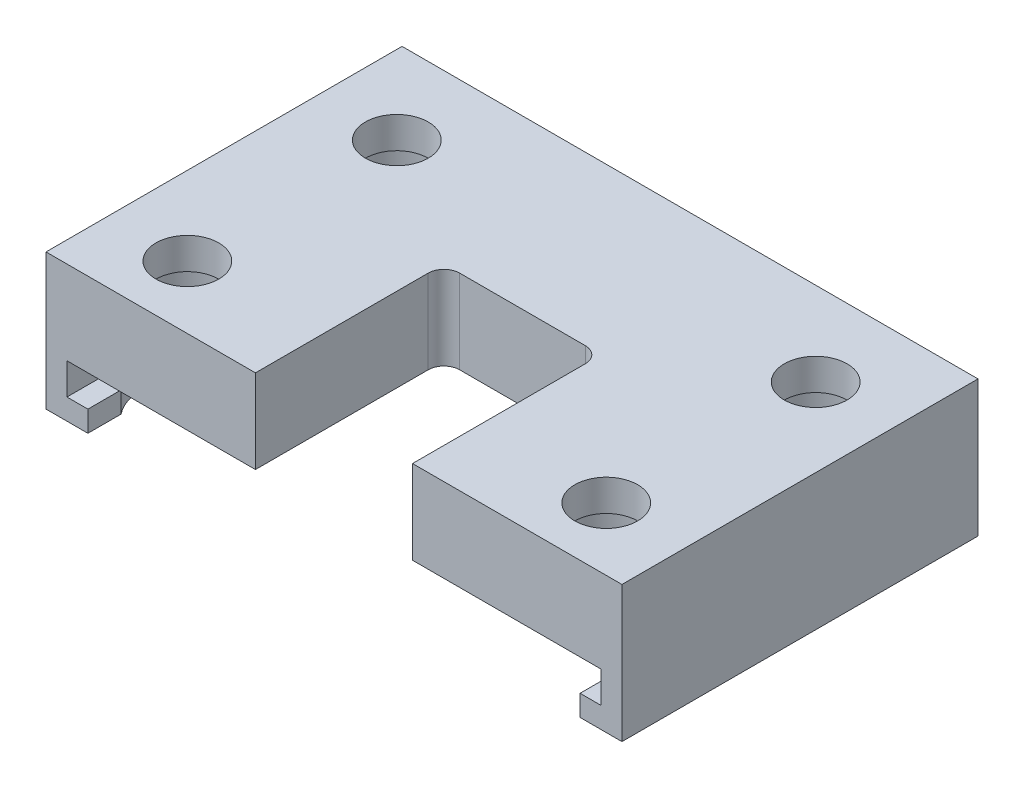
from build123d import *

# Parameters (mm, degrees)
CROQUIS1_W                   = 55
CROQUIS1_H                   = 31
SALIENTE_EXTRUIR1_DEPTH      = 8
SALIENTE_EXTRUIR2_DEPTH      = 5.5
SALIENTE_EXTRUIR2_DEPTH_BACK = 25.5
CROQUIS3_W                   = 55
CROQUIS3_H                   = 8
SALIENTE_EXTRUIR3_DEPTH      = 4
CORTAR_EXTRUIR1_DEPTH        = 67.475559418
TALADRO1_AT_2_COUNT          = 2
TALADRO1_AT_2_PITCH          = 40
TALADRO1_AT_3_COUNT          = 2
TALADRO1_AT_3_PITCH          = 20
TALADRO1_AT_4_COUNT          = 2
TALADRO1_AT_4_PITCH          = 44.72135955
REDONDEO1_R                  = 1.5
CROQUIS9_R                   = 4.5
CORTAR_EXTRUIR2_DEPTH        = 2
SALIENTE_EXTRUIR5_DEPTH      = 3


with BuildPart() as part:
    # Croquis1 → Saliente-Extruir1 (new body)
    with BuildSketch(Plane.XZ.offset(-3.05)):
        with Locations((27.5, 15.5)):
            Rectangle(CROQUIS1_W, CROQUIS1_H)
    extrude(amount=-SALIENTE_EXTRUIR1_DEPTH)

    # Croquis2 → Saliente-Extruir2 (add, two sides: drawn at the far end of the back side and taken through both)
    with BuildSketch(Plane.XY.offset(25.5).offset(-SALIENTE_EXTRUIR2_DEPTH_BACK)):
        Polygon((0, 3.05), (0, -1.95), (4, -1.95), (4, 0.05), (2, 0.05), (2, 3.05), align=None)
        Polygon((55, -1.95), (51, -1.95), (51, 0.05), (53, 0.05), (53, 3.05), (55, 3.05), align=None)
    extrude(amount=SALIENTE_EXTRUIR2_DEPTH + SALIENTE_EXTRUIR2_DEPTH_BACK)

    # Croquis3 → Saliente-Extruir3 (add)
    with BuildSketch(Plane.XY.offset(31)):
        with Locations((27.5, 7.05)):
            Rectangle(CROQUIS3_W, CROQUIS3_H)
    extrude(amount=SALIENTE_EXTRUIR3_DEPTH)

    # Croquis6 → Cortar-Extruir1 (cut, through all)
    with BuildSketch(Plane(origin=(0, 11.05, 0), x_dir=(-1, 0, 0), z_dir=(0, 1, 0))):
        Polygon((-35, 34), (-35, 16), (-20, 16), (-20, 34), (0, 34), (0, 35), (-55, 35), (-55, 34), align=None)
    extrude(amount=-CORTAR_EXTRUIR1_DEPTH, mode=Mode.SUBTRACT)

    # Croquis7 → Taladro1 (revolve, cut)
    with BuildSketch(Plane(origin=(7.5, 3.05, 8), x_dir=(0, 0, -1), z_dir=(1, 0, 0))):
        Polygon((0, 0), (0, 8), (3, 8), (3, 5), (4.5, 5), (4.5, 0), align=None)
    taladro1 = revolve(axis=Axis((7.5, 113.05, 8), (0, -1, 0)), mode=Mode.SUBTRACT)

    # Taladro1 at 2: Taladro1 ×2
    with Locations(*[(i * TALADRO1_AT_2_PITCH, 0, 0) for i in range(1, TALADRO1_AT_2_COUNT)]):
        add(taladro1, mode=Mode.SUBTRACT)

    # Taladro1 at 3: Taladro1 ×2
    with Locations(*[(0, 0, i * TALADRO1_AT_3_PITCH) for i in range(1, TALADRO1_AT_3_COUNT)]):
        add(taladro1, mode=Mode.SUBTRACT)

    # Taladro1 at 4: Taladro1 ×2
    with Locations(*[Vector(0.8944271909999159, 0, 0.447213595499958) * (i * TALADRO1_AT_4_PITCH) for i in range(1, TALADRO1_AT_4_COUNT)]):
        add(taladro1, mode=Mode.SUBTRACT)

    # Redondeo1
    redondeo1_edges = [part.edges().sort_by_distance(p)[0] for p in [
        (20, 7.05, 16),
        (35, 7.05, 16),
    ]]
    fillet(redondeo1_edges, radius=REDONDEO1_R)

    # Croquis9 → Cortar-Extruir2 (cut)
    with BuildSketch(Plane.XZ.offset(1.95)):
        with Locations(Location((7.5, 28, 0), (0, 0, 270))):
            Circle(CROQUIS9_R)
        with Locations(Location((47.5, 28, 0), (0, 0, 270))):
            Circle(CROQUIS9_R)
        with Locations(Location((47.5, 8, 0), (0, 0, 270))):
            Circle(CROQUIS9_R)
        with Locations(Location((7.5, 8, 0), (0, 0, 270))):
            Circle(CROQUIS9_R)
    extrude(amount=-CORTAR_EXTRUIR2_DEPTH, mode=Mode.SUBTRACT)

    # Croquis13 → Saliente-Extruir5 (add)
    with BuildSketch(Plane.XY.offset(31)):
        Polygon((55, 3.05), (53, 3.05), (53, 0.05), (51, 0.05), (51, -1.95), (55, -1.95), align=None)
        Polygon((2, 3.05), (0, 3.05), (0, -1.95), (4, -1.95), (4, 0.05), (2, 0.05), align=None)
    extrude(amount=SALIENTE_EXTRUIR5_DEPTH)


solid = part.part
